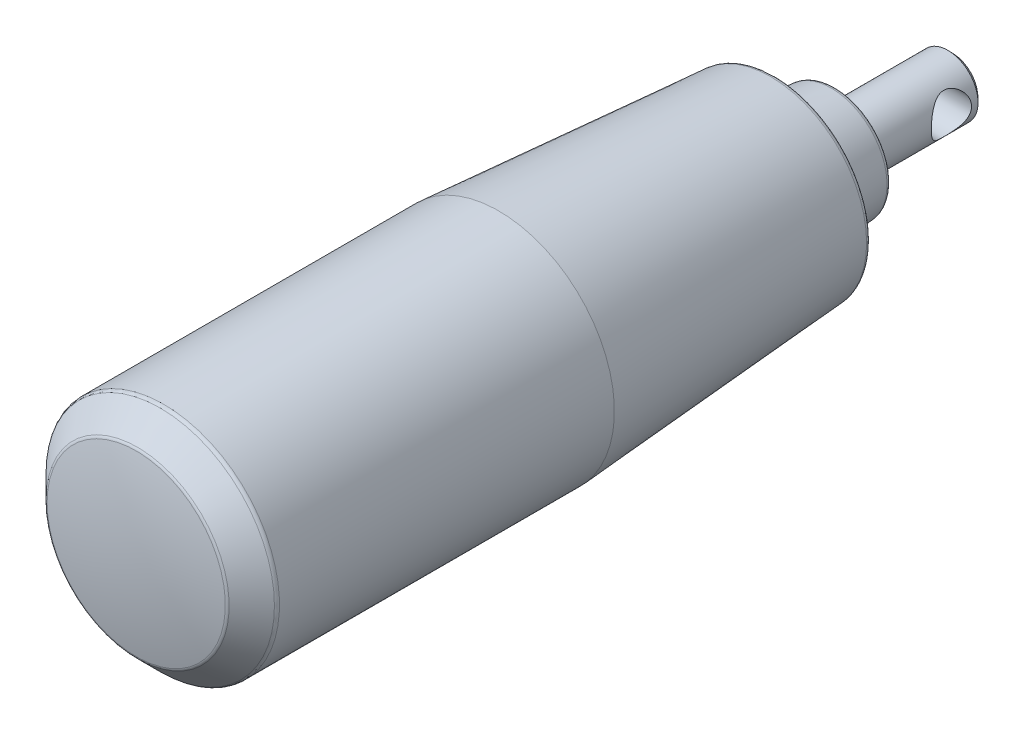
ISO-10303-21;
HEADER;
FILE_DESCRIPTION(('STEP AP214'),'2;1');
FILE_NAME('part.step','',(''),(''),'','','');
FILE_SCHEMA(('AUTOMOTIVE_DESIGN { 1 0 10303 214 1 1 1 1 }'));
ENDSEC;
DATA;
#1=APPLICATION_CONTEXT('core data for automotive mechanical design processes');
#2=APPLICATION_PROTOCOL_DEFINITION('international standard','automotive_design',2000,#1);
#3=PRODUCT_CONTEXT('',#1,'mechanical');
#4=PRODUCT('Part','Part','',(#3));
#5=PRODUCT_RELATED_PRODUCT_CATEGORY('part','',(#4));
#6=PRODUCT_DEFINITION_FORMATION('','',#4);
#7=PRODUCT_DEFINITION_CONTEXT('part definition',#1,'design');
#8=PRODUCT_DEFINITION('design','',#6,#7);
#9=PRODUCT_DEFINITION_SHAPE('','',#8);
#10=(LENGTH_UNIT() NAMED_UNIT(*) SI_UNIT(.MILLI.,.METRE.));
#11=(NAMED_UNIT(*) PLANE_ANGLE_UNIT() SI_UNIT($,.RADIAN.));
#12=(NAMED_UNIT(*) SI_UNIT($,.STERADIAN.) SOLID_ANGLE_UNIT());
#13=UNCERTAINTY_MEASURE_WITH_UNIT(LENGTH_MEASURE(1.E-05),#10,'distance_accuracy_value','');
#14=(GEOMETRIC_REPRESENTATION_CONTEXT(3) GLOBAL_UNCERTAINTY_ASSIGNED_CONTEXT((#13)) GLOBAL_UNIT_ASSIGNED_CONTEXT((#10,
#11,#12)) REPRESENTATION_CONTEXT('',''));
#15=CARTESIAN_POINT('',(0.,0.,0.));
#16=DIRECTION('',(0.,0.,1.));
#17=DIRECTION('',(1.,0.,0.));
#18=AXIS2_PLACEMENT_3D('',#15,#16,#17);
#19=CARTESIAN_POINT('',(0.,0.,38.));
#20=DIRECTION('',(1.,0.,0.));
#21=DIRECTION('',(0.,0.,-1.));
#22=AXIS2_PLACEMENT_3D('',#19,#20,#21);
#23=SPHERICAL_SURFACE('',#22,41.0000000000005);
#24=CARTESIAN_POINT('',(0.,0.,38.));
#25=DIRECTION('',(0.,0.,-1.));
#26=DIRECTION('',(-1.,0.,0.));
#27=AXIS2_PLACEMENT_3D('',#24,#25,#26);
#28=SPHERICAL_SURFACE('',#27,41.0000000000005);
#29=CARTESIAN_POINT('',(0.,-7.71377017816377E-07,78.031851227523));
#30=DIRECTION('',(0.,0.,-1.));
#31=DIRECTION('',(-1.,0.,0.));
#32=AXIS2_PLACEMENT_3D('',#29,#30,#31);
#33=CIRCLE('',#32,8.85725132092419);
#34=CARTESIAN_POINT('',(-8.85725132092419,-7.71377017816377E-07,78.031851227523));
#35=VERTEX_POINT('',#34);
#36=EDGE_CURVE('E109',#35,#35,#33,.T.);
#37=ORIENTED_EDGE('',*,*,#36,.F.);
#38=EDGE_LOOP('',(#37));
#39=FACE_BOUND('',#38,.T.);
#40=ADVANCED_FACE('F12',(#39),#28,.T.);
#41=CARTESIAN_POINT('',(0.,0.,0.));
#42=DIRECTION('',(1.,0.,0.));
#43=DIRECTION('',(0.,0.,-1.));
#44=AXIS2_PLACEMENT_3D('',#41,#42,#43);
#45=SPHERICAL_SURFACE('',#44,4.);
#46=CARTESIAN_POINT('',(0.,0.,0.));
#47=DIRECTION('',(0.,0.,-1.));
#48=DIRECTION('',(-1.,0.,0.));
#49=AXIS2_PLACEMENT_3D('',#46,#47,#48);
#50=SPHERICAL_SURFACE('',#49,4.);
#51=CARTESIAN_POINT('',(0.,-7.71377017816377E-07,-2.645751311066));
#52=DIRECTION('',(0.,0.,-1.));
#53=DIRECTION('',(-1.,0.,0.));
#54=AXIS2_PLACEMENT_3D('',#51,#52,#53);
#55=CIRCLE('',#54,3.00000077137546);
#56=CARTESIAN_POINT('',(-3.00000077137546,-7.71377017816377E-07,-2.645751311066));
#57=VERTEX_POINT('',#56);
#58=EDGE_CURVE('E8',#57,#57,#55,.T.);
#59=ORIENTED_EDGE('',*,*,#58,.T.);
#60=EDGE_LOOP('',(#59));
#61=FACE_BOUND('',#60,.T.);
#62=ADVANCED_FACE('F97',(#61),#50,.T.);
#63=CARTESIAN_POINT('',(0.,-7.71377017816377E-07,-10.));
#64=DIRECTION('',(0.,0.,-1.));
#65=DIRECTION('',(-1.,0.,0.));
#66=AXIS2_PLACEMENT_3D('',#63,#64,#65);
#67=CYLINDRICAL_SURFACE('',#66,3.00000077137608);
#68=CARTESIAN_POINT('',(-3.00000077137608,-7.71377017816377E-07,2.));
#69=CARTESIAN_POINT('',(-3.00000118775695,-0.10048549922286,2.0000005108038));
#70=CARTESIAN_POINT('',(-2.9949087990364,-0.200969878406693,1.99238595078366));
#71=CARTESIAN_POINT('',(-2.97504729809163,-0.398733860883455,1.96240297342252));
#72=CARTESIAN_POINT('',(-2.96027359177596,-0.496011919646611,1.94002755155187));
#73=CARTESIAN_POINT('',(-2.9225056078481,-0.684213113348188,1.88189199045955));
#74=CARTESIAN_POINT('',(-2.89954984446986,-0.775163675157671,1.8461945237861));
#75=CARTESIAN_POINT('',(-2.84726218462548,-0.949416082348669,1.7629362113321));
#76=CARTESIAN_POINT('',(-2.81792936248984,-1.03271681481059,1.71537364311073));
#77=CARTESIAN_POINT('',(-2.75227413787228,-1.19728546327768,1.60534249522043));
#78=CARTESIAN_POINT('',(-2.71556983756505,-1.27778105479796,1.54195151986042));
#79=CARTESIAN_POINT('',(-2.63982403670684,-1.42772876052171,1.40426922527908));
#80=CARTESIAN_POINT('',(-2.60077923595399,-1.49716475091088,1.32996228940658));
#81=CARTESIAN_POINT('',(-2.51728365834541,-1.63422360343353,1.15894675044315));
#82=CARTESIAN_POINT('',(-2.47295174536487,-1.69983244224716,1.06055342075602));
#83=CARTESIAN_POINT('',(-2.39084266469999,-1.81350404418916,0.851635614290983));
#84=CARTESIAN_POINT('',(-2.35305422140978,-1.86159715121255,0.741132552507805));
#85=CARTESIAN_POINT('',(-2.29976405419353,-1.92674066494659,0.543287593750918));
#86=CARTESIAN_POINT('',(-2.28097772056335,-1.94874474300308,0.458470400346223));
#87=CARTESIAN_POINT('',(-2.25258124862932,-1.98150635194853,0.285254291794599));
#88=CARTESIAN_POINT('',(-2.242955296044,-1.99228326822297,0.196861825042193));
#89=CARTESIAN_POINT('',(-2.23436777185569,-2.00191365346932,0.0185239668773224));
#90=CARTESIAN_POINT('',(-2.23544979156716,-2.00071838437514,-0.0714262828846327));
#91=CARTESIAN_POINT('',(-2.24819960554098,-1.98637565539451,-0.249636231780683));
#92=CARTESIAN_POINT('',(-2.25987636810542,-1.97321806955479,-0.337894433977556));
#93=CARTESIAN_POINT('',(-2.29127380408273,-1.93664960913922,-0.5064683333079));
#94=CARTESIAN_POINT('',(-2.31061685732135,-1.91371671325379,-0.586962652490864));
#95=CARTESIAN_POINT('',(-2.35509825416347,-1.8587006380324,-0.743025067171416));
#96=CARTESIAN_POINT('',(-2.38023850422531,-1.82661444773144,-0.818591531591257));
#97=CARTESIAN_POINT('',(-2.4396440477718,-1.74673737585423,-0.97902685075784));
#98=CARTESIAN_POINT('',(-2.47472527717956,-1.69707960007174,-1.06266138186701));
#99=CARTESIAN_POINT('',(-2.54691749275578,-1.58668844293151,-1.22138491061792));
#100=CARTESIAN_POINT('',(-2.584030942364,-1.52594140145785,-1.2964631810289));
#101=CARTESIAN_POINT('',(-2.66543550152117,-1.3798101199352,-1.45254400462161));
#102=CARTESIAN_POINT('',(-2.70954945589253,-1.29193773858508,-1.53133543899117));
#103=CARTESIAN_POINT('',(-2.79218287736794,-1.10200613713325,-1.67319772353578));
#104=CARTESIAN_POINT('',(-2.83070756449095,-0.999960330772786,-1.73628328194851));
#105=CARTESIAN_POINT('',(-2.89145563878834,-0.804855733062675,-1.83347863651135));
#106=CARTESIAN_POINT('',(-2.91539411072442,-0.71395553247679,-1.87084416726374));
#107=CARTESIAN_POINT('',(-2.95507848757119,-0.526033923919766,-1.93210550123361));
#108=CARTESIAN_POINT('',(-2.97083131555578,-0.429017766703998,-1.95601268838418));
#109=CARTESIAN_POINT('',(-2.99275981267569,-0.230983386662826,-1.98916140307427));
#110=CARTESIAN_POINT('',(-2.99889411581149,-0.12994978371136,-1.99833959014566));
#111=CARTESIAN_POINT('',(-3.00083185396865,0.0724434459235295,-2.00124701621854));
#112=CARTESIAN_POINT('',(-2.99663601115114,0.173803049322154,-1.99497733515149));
#113=CARTESIAN_POINT('',(-2.97899635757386,0.366457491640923,-1.9683756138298));
#114=CARTESIAN_POINT('',(-2.96622285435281,0.457959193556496,-1.94906229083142));
#115=CARTESIAN_POINT('',(-2.93318474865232,0.636118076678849,-1.89840374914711));
#116=CARTESIAN_POINT('',(-2.91291895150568,0.722774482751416,-1.86705661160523));
#117=CARTESIAN_POINT('',(-2.86496359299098,0.894666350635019,-1.79134690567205));
#118=CARTESIAN_POINT('',(-2.83689870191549,0.979497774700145,-1.74631095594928));
#119=CARTESIAN_POINT('',(-2.77601843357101,1.14068457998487,-1.64556563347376));
#120=CARTESIAN_POINT('',(-2.74320012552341,1.21703468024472,-1.58984966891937));
#121=CARTESIAN_POINT('',(-2.66954517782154,1.37185593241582,-1.4593907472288));
#122=CARTESIAN_POINT('',(-2.62826122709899,1.44875331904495,-1.38303223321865));
#123=CARTESIAN_POINT('',(-2.5457113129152,1.58934103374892,-1.21888681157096));
#124=CARTESIAN_POINT('',(-2.50444538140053,1.65302223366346,-1.1310920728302));
#125=CARTESIAN_POINT('',(-2.42939640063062,1.76124883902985,-0.952855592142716));
#126=CARTESIAN_POINT('',(-2.39527565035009,1.80695729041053,-0.863266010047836));
#127=CARTESIAN_POINT('',(-2.33438957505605,1.88496279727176,-0.676125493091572));
#128=CARTESIAN_POINT('',(-2.30761104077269,1.91728399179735,-0.578589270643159));
#129=CARTESIAN_POINT('',(-2.26933213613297,1.96235877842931,-0.395433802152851));
#130=CARTESIAN_POINT('',(-2.25595009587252,1.97758624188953,-0.310826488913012));
#131=CARTESIAN_POINT('',(-2.23879490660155,1.99699217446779,-0.139425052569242));
#132=CARTESIAN_POINT('',(-2.23501132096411,2.00118264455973,-0.0526334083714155));
#133=CARTESIAN_POINT('',(-2.23764244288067,1.99823912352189,0.120644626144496));
#134=CARTESIAN_POINT('',(-2.24406318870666,1.99109842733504,0.207130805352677));
#135=CARTESIAN_POINT('',(-2.26610511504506,1.96596969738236,0.377344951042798));
#136=CARTESIAN_POINT('',(-2.28173856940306,1.94796719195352,0.461069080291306));
#137=CARTESIAN_POINT('',(-2.3252691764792,1.89592990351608,0.645712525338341));
#138=CARTESIAN_POINT('',(-2.35532413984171,1.8589013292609,0.745269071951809));
#139=CARTESIAN_POINT('',(-2.42222253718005,1.7708445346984,0.93548821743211));
#140=CARTESIAN_POINT('',(-2.45907547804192,1.71979665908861,1.02613808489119));
#141=CARTESIAN_POINT('',(-2.53617294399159,1.60398177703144,1.19928326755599));
#142=CARTESIAN_POINT('',(-2.57646699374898,1.53898196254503,1.28160011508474));
#143=CARTESIAN_POINT('',(-2.65628420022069,1.39671631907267,1.43532380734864));
#144=CARTESIAN_POINT('',(-2.6958071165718,1.31944673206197,1.50672729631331));
#145=CARTESIAN_POINT('',(-2.77631673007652,1.1414556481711,1.64671327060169));
#146=CARTESIAN_POINT('',(-2.81669924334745,1.03895990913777,1.71341970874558));
#147=CARTESIAN_POINT('',(-2.8877777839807,0.820866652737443,1.82791413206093));
#148=CARTESIAN_POINT('',(-2.9184890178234,0.705290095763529,1.87573184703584));
#149=CARTESIAN_POINT('',(-2.96101740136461,0.491433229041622,1.94115503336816));
#150=CARTESIAN_POINT('',(-2.97551569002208,0.395010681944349,1.96311135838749));
#151=CARTESIAN_POINT('',(-2.9950035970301,0.199056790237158,1.99252814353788));
#152=CARTESIAN_POINT('',(-3.00000035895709,0.0995278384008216,1.99999949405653));
#153=CARTESIAN_POINT('',(-3.00000077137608,-7.71377017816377E-07,2.));
#154=B_SPLINE_CURVE_WITH_KNOTS('',3,(#68,#69,#70,#71,#72,#73,#74,#75,#76,#77,#78,#79,#80,#81,
#82,#83,#84,#85,#86,#87,#88,#89,#90,#91,#92,#93,#94,#95,#96,#97,#98,#99,#100,#101,#102,#103,
#104,#105,#106,#107,#108,#109,#110,#111,#112,#113,#114,#115,#116,#117,#118,#119,#120,#121,#122,
#123,#124,#125,#126,#127,#128,#129,#130,#131,#132,#133,#134,#135,#136,#137,#138,#139,#140,#141,
#142,#143,#144,#145,#146,#147,#148,#149,#150,#151,#152,#153),.UNSPECIFIED.,.T.,.F.,(4,2,2,2,2,2,
2,2,2,2,2,2,2,2,2,2,2,2,2,2,2,2,2,2,2,2,2,2,2,2,2,2,2,2,2,2,2,2,2,2,2,2,4),(0.,
0.301053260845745,0.602249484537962,0.902046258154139,1.20188657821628,1.52717047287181,
1.85292434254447,2.23006703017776,2.60655322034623,2.87433713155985,3.14165790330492,
3.4100673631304,3.67870424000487,3.93548906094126,4.19235844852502,4.50147659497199,
4.81097812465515,5.18719067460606,5.56304957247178,5.86524189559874,6.1671782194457,
6.47040954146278,6.77361966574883,7.05553140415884,7.33748811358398,7.63652418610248,
7.93574542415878,8.28228286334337,8.62905885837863,8.94650033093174,9.26336689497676,
9.52324101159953,9.78283243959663,10.0425775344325,10.3026694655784,10.6320665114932,
10.9619277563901,11.2977932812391,11.6337618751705,12.0179545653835,12.4015401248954,
12.6999532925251,12.9981420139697),.UNSPECIFIED.);
#155=CARTESIAN_POINT('',(-3.00000077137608,-7.71377017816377E-07,2.));
#156=VERTEX_POINT('',#155);
#157=EDGE_CURVE('E15',#156,#156,#154,.T.);
#158=ORIENTED_EDGE('',*,*,#157,.T.);
#159=EDGE_LOOP('',(#158));
#160=FACE_BOUND('',#159,.T.);
#161=CARTESIAN_POINT('',(3.00000077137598,0.,-2.));
#162=CARTESIAN_POINT('',(3.00000121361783,-0.100484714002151,-2.00000054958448));
#163=CARTESIAN_POINT('',(2.99490885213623,-0.200969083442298,-1.99238603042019));
#164=CARTESIAN_POINT('',(2.97504740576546,-0.398733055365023,-1.96240313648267));
#165=CARTESIAN_POINT('',(2.96027372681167,-0.496011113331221,-1.94002775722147));
#166=CARTESIAN_POINT('',(2.92250579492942,-0.684212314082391,-1.88189228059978));
#167=CARTESIAN_POINT('',(2.89955005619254,-0.775162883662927,-1.84619485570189));
#168=CARTESIAN_POINT('',(2.8472624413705,-0.94941531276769,-1.76293662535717));
#169=CARTESIAN_POINT('',(2.81792963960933,-1.03271605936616,-1.71537409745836));
#170=CARTESIAN_POINT('',(2.75227445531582,-1.19728473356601,-1.60534303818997));
#171=CARTESIAN_POINT('',(2.71557017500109,-1.27778033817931,-1.54195211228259));
#172=CARTESIAN_POINT('',(2.63982440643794,-1.42772807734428,-1.40426991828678));
#173=CARTESIAN_POINT('',(2.60077961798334,-1.49716408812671,-1.32996303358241));
#174=CARTESIAN_POINT('',(2.51728405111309,-1.63422299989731,-1.15894759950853));
#175=CARTESIAN_POINT('',(2.47295213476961,-1.69983187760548,-1.06055432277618));
#176=CARTESIAN_POINT('',(2.39084302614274,-1.81350356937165,-0.851636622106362));
#177=CARTESIAN_POINT('',(2.3530545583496,-1.86159672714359,-0.741133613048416));
#178=CARTESIAN_POINT('',(2.29976431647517,-1.92674035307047,-0.54328870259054));
#179=CARTESIAN_POINT('',(2.28097794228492,-1.94874448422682,-0.458471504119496));
#180=CARTESIAN_POINT('',(2.2525813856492,-1.98150619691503,-0.28525537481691));
#181=CARTESIAN_POINT('',(2.24295538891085,-1.99228316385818,-0.196862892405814));
#182=CARTESIAN_POINT('',(2.23436777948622,-2.00191364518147,-0.0185249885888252));
#183=CARTESIAN_POINT('',(2.23544975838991,-2.00071842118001,0.071425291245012));
#184=CARTESIAN_POINT('',(2.24819950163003,-1.98637577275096,0.24963530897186));
#185=CARTESIAN_POINT('',(2.25987623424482,-1.97321822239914,0.337893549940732));
#186=CARTESIAN_POINT('',(2.29127361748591,-1.9366498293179,0.506467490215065));
#187=CARTESIAN_POINT('',(2.31061664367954,-1.91371697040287,0.586961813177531));
#188=CARTESIAN_POINT('',(2.35509799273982,-1.8587009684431,0.743024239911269));
#189=CARTESIAN_POINT('',(2.38023822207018,-1.82661481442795,0.818590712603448));
#190=CARTESIAN_POINT('',(2.43964371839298,-1.74673783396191,0.979026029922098));
#191=CARTESIAN_POINT('',(2.47472492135,-1.69708011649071,1.06266055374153));
#192=CARTESIAN_POINT('',(2.54691709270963,-1.58668908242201,1.22138407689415));
#193=CARTESIAN_POINT('',(2.58403052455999,-1.52594210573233,1.2964623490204));
#194=CARTESIAN_POINT('',(2.66543506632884,-1.37981095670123,1.45254320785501));
#195=CARTESIAN_POINT('',(2.70954902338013,-1.2919386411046,1.53133467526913));
#196=CARTESIAN_POINT('',(2.79218246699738,-1.10200717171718,1.67319704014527));
#197=CARTESIAN_POINT('',(2.83070717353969,-0.99996143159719,1.73628264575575));
#198=CARTESIAN_POINT('',(2.89145531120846,-0.804856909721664,1.83347812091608));
#199=CARTESIAN_POINT('',(2.91539382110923,-0.713956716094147,1.87084371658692));
#200=CARTESIAN_POINT('',(2.95507827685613,-0.526035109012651,1.93210517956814));
#201=CARTESIAN_POINT('',(2.97083114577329,-0.429018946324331,1.95601243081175));
#202=CARTESIAN_POINT('',(2.99275972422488,-0.230984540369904,1.98916127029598));
#203=CARTESIAN_POINT('',(2.9988940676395,-0.129950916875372,1.99833951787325));
#204=CARTESIAN_POINT('',(3.00083188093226,0.0724423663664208,2.00124705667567));
#205=CARTESIAN_POINT('',(2.99663607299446,0.173802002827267,1.99497742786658));
#206=CARTESIAN_POINT('',(2.9789964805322,0.366456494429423,1.96837579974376));
#207=CARTESIAN_POINT('',(2.96622300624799,0.457958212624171,1.94906252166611));
#208=CARTESIAN_POINT('',(2.93318495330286,0.63611713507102,1.89840406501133));
#209=CARTESIAN_POINT('',(2.91291917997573,0.722773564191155,1.8670569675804));
#210=CARTESIAN_POINT('',(2.86496387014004,0.894665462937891,1.79134734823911));
#211=CARTESIAN_POINT('',(2.8368990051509,0.97949689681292,1.74631144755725));
#212=CARTESIAN_POINT('',(2.77601878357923,1.1406837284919,1.64556622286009));
#213=CARTESIAN_POINT('',(2.74320049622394,1.21703384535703,1.58985030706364));
#214=CARTESIAN_POINT('',(2.66954558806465,1.37185513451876,1.45939149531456));
#215=CARTESIAN_POINT('',(2.6282616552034,1.44875254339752,1.38303304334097));
#216=CARTESIAN_POINT('',(2.54571176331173,1.58934031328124,1.21888774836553));
#217=CARTESIAN_POINT('',(2.5044458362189,1.65302154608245,1.131093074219));
#218=CARTESIAN_POINT('',(2.42939681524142,1.76124827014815,0.952856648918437));
#219=CARTESIAN_POINT('',(2.39527602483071,1.80695679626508,0.863267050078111));
#220=CARTESIAN_POINT('',(2.33438986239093,1.88496244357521,0.676126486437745));
#221=CARTESIAN_POINT('',(2.30761128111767,1.91728370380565,0.57859023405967));
#222=CARTESIAN_POINT('',(2.26933229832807,1.96235859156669,0.395434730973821));
#223=CARTESIAN_POINT('',(2.25595022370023,1.97758609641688,0.310827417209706));
#224=CARTESIAN_POINT('',(2.23879496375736,1.99699211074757,0.139425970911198));
#225=CARTESIAN_POINT('',(2.23501134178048,2.00118262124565,0.0526343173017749));
#226=CARTESIAN_POINT('',(2.2376423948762,1.99823917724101,-0.120643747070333));
#227=CARTESIAN_POINT('',(2.24406310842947,1.99109851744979,-0.207129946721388));
#228=CARTESIAN_POINT('',(2.26610497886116,1.96596985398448,-0.377344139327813));
#229=CARTESIAN_POINT('',(2.28173840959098,1.94796737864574,-0.461068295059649));
#230=CARTESIAN_POINT('',(2.32526896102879,1.89593016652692,-0.645711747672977));
#231=CARTESIAN_POINT('',(2.35532388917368,1.8589016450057,-0.745268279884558));
#232=CARTESIAN_POINT('',(2.42222222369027,1.77084496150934,-0.935487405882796));
#233=CARTESIAN_POINT('',(2.45907513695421,1.71979714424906,-1.02613726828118));
#234=CARTESIAN_POINT('',(2.5361725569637,1.60398238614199,-1.19928244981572));
#235=CARTESIAN_POINT('',(2.57646658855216,1.53898263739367,-1.28159930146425));
#236=CARTESIAN_POINT('',(2.65628377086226,1.39671713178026,-1.43532301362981));
#237=CARTESIAN_POINT('',(2.69580668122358,1.31944761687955,-1.50672651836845));
#238=CARTESIAN_POINT('',(2.77631631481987,1.14145665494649,-1.64671257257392));
#239=CARTESIAN_POINT('',(2.81669885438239,1.03896096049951,-1.71341907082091));
#240=CARTESIAN_POINT('',(2.88777746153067,0.820867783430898,-1.82791362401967));
#241=CARTESIAN_POINT('',(2.91848873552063,0.705291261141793,-1.87573140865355));
#242=CARTESIAN_POINT('',(2.96101721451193,0.491434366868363,-1.94115474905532));
#243=CARTESIAN_POINT('',(2.97551554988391,0.395011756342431,-1.96311114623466));
#244=CARTESIAN_POINT('',(2.99500353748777,0.199057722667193,-1.99252805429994));
#245=CARTESIAN_POINT('',(3.00000033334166,0.0995286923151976,-1.99999945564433));
#246=CARTESIAN_POINT('',(3.00000077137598,0.,-2.));
#247=B_SPLINE_CURVE_WITH_KNOTS('',3,(#161,#162,#163,#164,#165,#166,#167,#168,#169,#170,#171,
#172,#173,#174,#175,#176,#177,#178,#179,#180,#181,#182,#183,#184,#185,#186,#187,#188,#189,#190,
#191,#192,#193,#194,#195,#196,#197,#198,#199,#200,#201,#202,#203,#204,#205,#206,#207,#208,#209,
#210,#211,#212,#213,#214,#215,#216,#217,#218,#219,#220,#221,#222,#223,#224,#225,#226,#227,#228,
#229,#230,#231,#232,#233,#234,#235,#236,#237,#238,#239,#240,#241,#242,#243,#244,#245,#246),
.UNSPECIFIED.,.T.,.F.,(4,2,2,2,2,2,2,2,2,2,2,2,2,2,2,2,2,2,2,2,2,2,2,2,2,2,2,2,2,2,2,2,2,2,2,2,
2,2,2,2,2,2,4),(0.,0.301053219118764,0.602249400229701,0.902046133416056,1.20188641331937,
1.52717023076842,1.85292402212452,2.23006665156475,2.6065527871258,2.87433677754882,
3.14165762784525,3.4100671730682,3.67870413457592,3.93548891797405,4.19235826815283,
4.5014762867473,4.81097768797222,5.18719016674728,5.56304899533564,5.86524139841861,
6.16717780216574,6.47040920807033,6.77361941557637,7.05553116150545,7.33748787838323,
7.6365238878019,7.93574506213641,8.28228240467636,8.62905830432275,8.94649995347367,
9.26336669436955,9.52324085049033,9.78283231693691,10.0425774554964,10.3026694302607,
10.6320663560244,10.9619274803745,11.2977928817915,11.6337613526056,12.017954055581,
12.4015396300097,12.699953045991,12.9981420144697),.UNSPECIFIED.);
#248=CARTESIAN_POINT('',(3.00000077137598,0.,-2.));
#249=VERTEX_POINT('',#248);
#250=EDGE_CURVE('E32',#249,#249,#247,.T.);
#251=ORIENTED_EDGE('',*,*,#250,.T.);
#252=EDGE_LOOP('',(#251));
#253=FACE_BOUND('',#252,.T.);
#254=ORIENTED_EDGE('',*,*,#58,.F.);
#255=EDGE_LOOP('',(#254));
#256=FACE_BOUND('',#255,.T.);
#257=CARTESIAN_POINT('',(0.,-7.71377017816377E-07,8.5));
#258=DIRECTION('',(0.,0.,-1.));
#259=DIRECTION('',(-1.,0.,0.));
#260=AXIS2_PLACEMENT_3D('',#257,#258,#259);
#261=CIRCLE('',#260,3.00000077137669);
#262=CARTESIAN_POINT('',(-3.00000077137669,-7.71377017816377E-07,8.5));
#263=VERTEX_POINT('',#262);
#264=EDGE_CURVE('E24',#263,#263,#261,.T.);
#265=ORIENTED_EDGE('',*,*,#264,.T.);
#266=EDGE_LOOP('',(#265));
#267=FACE_BOUND('',#266,.T.);
#268=ADVANCED_FACE('F37',(#160,#253,#256,#267),#67,.T.);
#269=CARTESIAN_POINT('',(0.,5.05543795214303,8.5));
#270=DIRECTION('',(0.,0.,1.));
#271=DIRECTION('',(1.,0.,0.));
#272=AXIS2_PLACEMENT_3D('',#269,#270,#271);
#273=PLANE('',#272);
#274=ORIENTED_EDGE('',*,*,#264,.F.);
#275=EDGE_LOOP('',(#274));
#276=FACE_BOUND('',#275,.T.);
#277=CARTESIAN_POINT('',(0.,-7.71377017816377E-07,8.5));
#278=DIRECTION('',(0.,0.,-1.));
#279=DIRECTION('',(-1.,0.,0.));
#280=AXIS2_PLACEMENT_3D('',#277,#278,#279);
#281=CIRCLE('',#280,5.05543872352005);
#282=CARTESIAN_POINT('',(-5.05543872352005,-7.71377017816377E-07,8.5));
#283=VERTEX_POINT('',#282);
#284=EDGE_CURVE('E29',#283,#283,#281,.T.);
#285=ORIENTED_EDGE('',*,*,#284,.T.);
#286=EDGE_LOOP('',(#285));
#287=FACE_BOUND('',#286,.T.);
#288=ADVANCED_FACE('F88',(#276,#287),#273,.F.);
#289=CARTESIAN_POINT('',(0.,-7.71377017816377E-07,9.));
#290=DIRECTION('',(0.,0.,-1.));
#291=DIRECTION('',(-1.,0.,0.));
#292=AXIS2_PLACEMENT_3D('',#289,#290,#291);
#293=TOROIDAL_SURFACE('',#292,5.05543872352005,0.499999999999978);
#294=CARTESIAN_POINT('',(0.,-7.71377017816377E-07,8.95591171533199));
#295=DIRECTION('',(0.,0.,-1.));
#296=DIRECTION('',(-1.,0.,0.));
#297=AXIS2_PLACEMENT_3D('',#294,#295,#296);
#298=CIRCLE('',#297,5.55349115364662);
#299=CARTESIAN_POINT('',(-5.55349115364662,-7.71377017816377E-07,8.95591171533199));
#300=VERTEX_POINT('',#299);
#301=EDGE_CURVE('E140',#300,#300,#298,.T.);
#302=ORIENTED_EDGE('',*,*,#301,.T.);
#303=EDGE_LOOP('',(#302));
#304=FACE_BOUND('',#303,.T.);
#305=ORIENTED_EDGE('',*,*,#284,.F.);
#306=EDGE_LOOP('',(#305));
#307=FACE_BOUND('',#306,.T.);
#308=ADVANCED_FACE('F85',(#304,#307),#293,.T.);
#309=CARTESIAN_POINT('',(0.,-7.71377017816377E-07,14.));
#310=DIRECTION('',(0.,0.,1.));
#311=DIRECTION('',(1.,0.,0.));
#312=AXIS2_PLACEMENT_3D('',#309,#310,#311);
#313=CONICAL_SURFACE('',#312,6.00000077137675,0.088291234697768);
#314=ORIENTED_EDGE('',*,*,#301,.F.);
#315=EDGE_LOOP('',(#314));
#316=FACE_BOUND('',#315,.T.);
#317=CARTESIAN_POINT('',(0.,-7.71377017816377E-07,14.));
#318=DIRECTION('',(0.,0.,-1.));
#319=DIRECTION('',(-1.,0.,0.));
#320=AXIS2_PLACEMENT_3D('',#317,#318,#319);
#321=CIRCLE('',#320,6.00000077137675);
#322=CARTESIAN_POINT('',(-6.00000077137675,-7.71377017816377E-07,14.));
#323=VERTEX_POINT('',#322);
#324=EDGE_CURVE('E137',#323,#323,#321,.T.);
#325=ORIENTED_EDGE('',*,*,#324,.T.);
#326=EDGE_LOOP('',(#325));
#327=FACE_BOUND('',#326,.T.);
#328=ADVANCED_FACE('F81',(#316,#327),#313,.T.);
#329=CARTESIAN_POINT('',(0.,6.,14.));
#330=DIRECTION('',(0.,0.,-1.));
#331=DIRECTION('',(-1.,0.,0.));
#332=AXIS2_PLACEMENT_3D('',#329,#330,#331);
#333=PLANE('',#332);
#334=CARTESIAN_POINT('',(0.,-7.71377017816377E-07,14.));
#335=DIRECTION('',(0.,0.,-1.));
#336=DIRECTION('',(-1.,0.,0.));
#337=AXIS2_PLACEMENT_3D('',#334,#335,#336);
#338=CIRCLE('',#337,7.50000077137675);
#339=CARTESIAN_POINT('',(-7.50000077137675,-7.71377017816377E-07,14.));
#340=VERTEX_POINT('',#339);
#341=EDGE_CURVE('E134',#340,#340,#338,.T.);
#342=ORIENTED_EDGE('',*,*,#341,.T.);
#343=EDGE_LOOP('',(#342));
#344=FACE_BOUND('',#343,.T.);
#345=ORIENTED_EDGE('',*,*,#324,.F.);
#346=EDGE_LOOP('',(#345));
#347=FACE_BOUND('',#346,.T.);
#348=ADVANCED_FACE('F77',(#344,#347),#333,.T.);
#349=CARTESIAN_POINT('',(0.,-7.71377017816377E-07,-10.));
#350=DIRECTION('',(0.,0.,-1.));
#351=DIRECTION('',(-1.,0.,0.));
#352=AXIS2_PLACEMENT_3D('',#349,#350,#351);
#353=CYLINDRICAL_SURFACE('',#352,7.50000077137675);
#354=ORIENTED_EDGE('',*,*,#341,.F.);
#355=EDGE_LOOP('',(#354));
#356=FACE_BOUND('',#355,.T.);
#357=CARTESIAN_POINT('',(0.,-7.71377017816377E-07,14.5));
#358=DIRECTION('',(0.,0.,-1.));
#359=DIRECTION('',(-1.,0.,0.));
#360=AXIS2_PLACEMENT_3D('',#357,#358,#359);
#361=CIRCLE('',#360,7.50000077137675);
#362=CARTESIAN_POINT('',(-7.50000077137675,-7.71377017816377E-07,14.5));
#363=VERTEX_POINT('',#362);
#364=EDGE_CURVE('E131',#363,#363,#361,.T.);
#365=ORIENTED_EDGE('',*,*,#364,.T.);
#366=EDGE_LOOP('',(#365));
#367=FACE_BOUND('',#366,.T.);
#368=ADVANCED_FACE('F73',(#356,#367),#353,.T.);
#369=CARTESIAN_POINT('',(0.,7.5,14.5));
#370=DIRECTION('',(0.,0.,-1.));
#371=DIRECTION('',(-1.,0.,0.));
#372=AXIS2_PLACEMENT_3D('',#369,#370,#371);
#373=PLANE('',#372);
#374=CARTESIAN_POINT('',(0.,-7.71377017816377E-07,14.5));
#375=DIRECTION('',(0.,0.,-1.));
#376=DIRECTION('',(-1.,0.,0.));
#377=AXIS2_PLACEMENT_3D('',#374,#375,#376);
#378=CIRCLE('',#377,9.03504383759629);
#379=CARTESIAN_POINT('',(-9.03504383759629,-7.71377017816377E-07,14.5));
#380=VERTEX_POINT('',#379);
#381=EDGE_CURVE('E128',#380,#380,#378,.T.);
#382=ORIENTED_EDGE('',*,*,#381,.T.);
#383=EDGE_LOOP('',(#382));
#384=FACE_BOUND('',#383,.T.);
#385=ORIENTED_EDGE('',*,*,#364,.F.);
#386=EDGE_LOOP('',(#385));
#387=FACE_BOUND('',#386,.T.);
#388=ADVANCED_FACE('F69',(#384,#387),#373,.T.);
#389=CARTESIAN_POINT('',(0.,-7.71377017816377E-07,15.));
#390=DIRECTION('',(0.,0.,-1.));
#391=DIRECTION('',(-1.,0.,0.));
#392=AXIS2_PLACEMENT_3D('',#389,#390,#391);
#393=TOROIDAL_SURFACE('',#392,9.03504383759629,0.500000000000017);
#394=CARTESIAN_POINT('',(0.,-7.71377017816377E-07,14.9637321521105));
#395=DIRECTION('',(0.,0.,-1.));
#396=DIRECTION('',(-1.,0.,0.));
#397=AXIS2_PLACEMENT_3D('',#394,#395,#396);
#398=CIRCLE('',#397,9.53372674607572);
#399=CARTESIAN_POINT('',(-9.53372674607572,-7.71377017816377E-07,14.9637321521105));
#400=VERTEX_POINT('',#399);
#401=EDGE_CURVE('E125',#400,#400,#398,.T.);
#402=ORIENTED_EDGE('',*,*,#401,.T.);
#403=EDGE_LOOP('',(#402));
#404=FACE_BOUND('',#403,.T.);
#405=ORIENTED_EDGE('',*,*,#381,.F.);
#406=EDGE_LOOP('',(#405));
#407=FACE_BOUND('',#406,.T.);
#408=ADVANCED_FACE('F65',(#404,#407),#393,.T.);
#409=CARTESIAN_POINT('',(0.,-7.71377017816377E-07,42.));
#410=DIRECTION('',(0.,0.,1.));
#411=DIRECTION('',(1.,0.,0.));
#412=AXIS2_PLACEMENT_3D('',#409,#410,#411);
#413=CONICAL_SURFACE('',#412,11.5000007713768,0.0725994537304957);
#414=ORIENTED_EDGE('',*,*,#401,.F.);
#415=EDGE_LOOP('',(#414));
#416=FACE_BOUND('',#415,.T.);
#417=CARTESIAN_POINT('',(0.,-7.71377017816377E-07,42.));
#418=DIRECTION('',(0.,0.,-1.));
#419=DIRECTION('',(-1.,0.,0.));
#420=AXIS2_PLACEMENT_3D('',#417,#418,#419);
#421=CIRCLE('',#420,11.5000007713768);
#422=CARTESIAN_POINT('',(-11.5000007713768,-7.71377017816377E-07,42.));
#423=VERTEX_POINT('',#422);
#424=EDGE_CURVE('E122',#423,#423,#421,.T.);
#425=ORIENTED_EDGE('',*,*,#424,.T.);
#426=EDGE_LOOP('',(#425));
#427=FACE_BOUND('',#426,.T.);
#428=ADVANCED_FACE('F61',(#416,#427),#413,.T.);
#429=CARTESIAN_POINT('',(0.,-7.71377017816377E-07,-10.));
#430=DIRECTION('',(0.,0.,-1.));
#431=DIRECTION('',(-1.,0.,0.));
#432=AXIS2_PLACEMENT_3D('',#429,#430,#431);
#433=CYLINDRICAL_SURFACE('',#432,11.5000007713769);
#434=ORIENTED_EDGE('',*,*,#424,.F.);
#435=EDGE_LOOP('',(#434));
#436=FACE_BOUND('',#435,.T.);
#437=CARTESIAN_POINT('',(0.,-7.71377017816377E-07,75.2928932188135));
#438=DIRECTION('',(0.,0.,-1.));
#439=DIRECTION('',(-1.,0.,0.));
#440=AXIS2_PLACEMENT_3D('',#437,#438,#439);
#441=CIRCLE('',#440,11.5000007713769);
#442=CARTESIAN_POINT('',(-11.5000007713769,-7.71377017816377E-07,75.2928932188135));
#443=VERTEX_POINT('',#442);
#444=EDGE_CURVE('E119',#443,#443,#441,.T.);
#445=ORIENTED_EDGE('',*,*,#444,.T.);
#446=EDGE_LOOP('',(#445));
#447=FACE_BOUND('',#446,.T.);
#448=ADVANCED_FACE('F57',(#436,#447),#433,.T.);
#449=CARTESIAN_POINT('',(0.,-7.71377017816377E-07,75.2928932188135));
#450=DIRECTION('',(0.,0.,-1.));
#451=DIRECTION('',(-1.,0.,0.));
#452=AXIS2_PLACEMENT_3D('',#449,#450,#451);
#453=TOROIDAL_SURFACE('',#452,11.0000007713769,0.500000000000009);
#454=CARTESIAN_POINT('',(0.,-7.71377017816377E-07,75.6464466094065));
#455=DIRECTION('',(0.,0.,-1.));
#456=DIRECTION('',(-1.,0.,0.));
#457=AXIS2_PLACEMENT_3D('',#454,#455,#456);
#458=CIRCLE('',#457,11.3535541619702);
#459=CARTESIAN_POINT('',(-11.3535541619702,-7.71377017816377E-07,75.6464466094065));
#460=VERTEX_POINT('',#459);
#461=EDGE_CURVE('E113',#460,#460,#458,.T.);
#462=ORIENTED_EDGE('',*,*,#461,.T.);
#463=EDGE_LOOP('',(#462));
#464=FACE_BOUND('',#463,.T.);
#465=ORIENTED_EDGE('',*,*,#444,.F.);
#466=EDGE_LOOP('',(#465));
#467=FACE_BOUND('',#466,.T.);
#468=ADVANCED_FACE('F53',(#464,#467),#453,.T.);
#469=CARTESIAN_POINT('',(0.,-7.71377017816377E-07,77.8972113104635));
#470=DIRECTION('',(0.,0.,-1.));
#471=DIRECTION('',(-1.,0.,0.));
#472=AXIS2_PLACEMENT_3D('',#469,#470,#471);
#473=CONICAL_SURFACE('',#472,9.1027894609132,0.785398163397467);
#474=ORIENTED_EDGE('',*,*,#461,.F.);
#475=EDGE_LOOP('',(#474));
#476=FACE_BOUND('',#475,.T.);
#477=CARTESIAN_POINT('',(0.,-7.71377017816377E-07,77.8972113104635));
#478=DIRECTION('',(0.,0.,-1.));
#479=DIRECTION('',(-1.,0.,0.));
#480=AXIS2_PLACEMENT_3D('',#477,#478,#479);
#481=CIRCLE('',#480,9.1027894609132);
#482=CARTESIAN_POINT('',(-9.1027894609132,-7.71377017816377E-07,77.8972113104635));
#483=VERTEX_POINT('',#482);
#484=EDGE_CURVE('E110',#483,#483,#481,.T.);
#485=ORIENTED_EDGE('',*,*,#484,.T.);
#486=EDGE_LOOP('',(#485));
#487=FACE_BOUND('',#486,.T.);
#488=ADVANCED_FACE('F49',(#476,#487),#473,.T.);
#489=CARTESIAN_POINT('',(0.,-7.71377017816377E-07,77.5436579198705));
#490=DIRECTION('',(0.,0.,-1.));
#491=DIRECTION('',(-1.,0.,0.));
#492=AXIS2_PLACEMENT_3D('',#489,#490,#491);
#493=TOROIDAL_SURFACE('',#492,8.74923607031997,0.499999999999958);
#494=ORIENTED_EDGE('',*,*,#36,.T.);
#495=EDGE_LOOP('',(#494));
#496=FACE_BOUND('',#495,.T.);
#497=ORIENTED_EDGE('',*,*,#484,.F.);
#498=EDGE_LOOP('',(#497));
#499=FACE_BOUND('',#498,.T.);
#500=ADVANCED_FACE('F44',(#496,#499),#493,.T.);
#501=CARTESIAN_POINT('',(-11.5000007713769,0.,0.));
#502=DIRECTION('',(1.,0.,0.));
#503=DIRECTION('',(0.,0.,-1.));
#504=AXIS2_PLACEMENT_3D('',#501,#502,#503);
#505=CYLINDRICAL_SURFACE('',#504,2.);
#506=ORIENTED_EDGE('',*,*,#250,.F.);
#507=EDGE_LOOP('',(#506));
#508=FACE_BOUND('',#507,.T.);
#509=ORIENTED_EDGE('',*,*,#157,.F.);
#510=EDGE_LOOP('',(#509));
#511=FACE_BOUND('',#510,.T.);
#512=ADVANCED_FACE('F40',(#508,#511),#505,.F.);
#513=CLOSED_SHELL('',(#40,#62,#268,#288,#308,#328,#348,#368,#388,#408,#428,#448,#468,#488,#500,#512));
#514=MANIFOLD_SOLID_BREP('B1',#513);
#515=ADVANCED_BREP_SHAPE_REPRESENTATION('',(#18,#514),#14);
#516=SHAPE_DEFINITION_REPRESENTATION(#9,#515);
ENDSEC;
END-ISO-10303-21;
